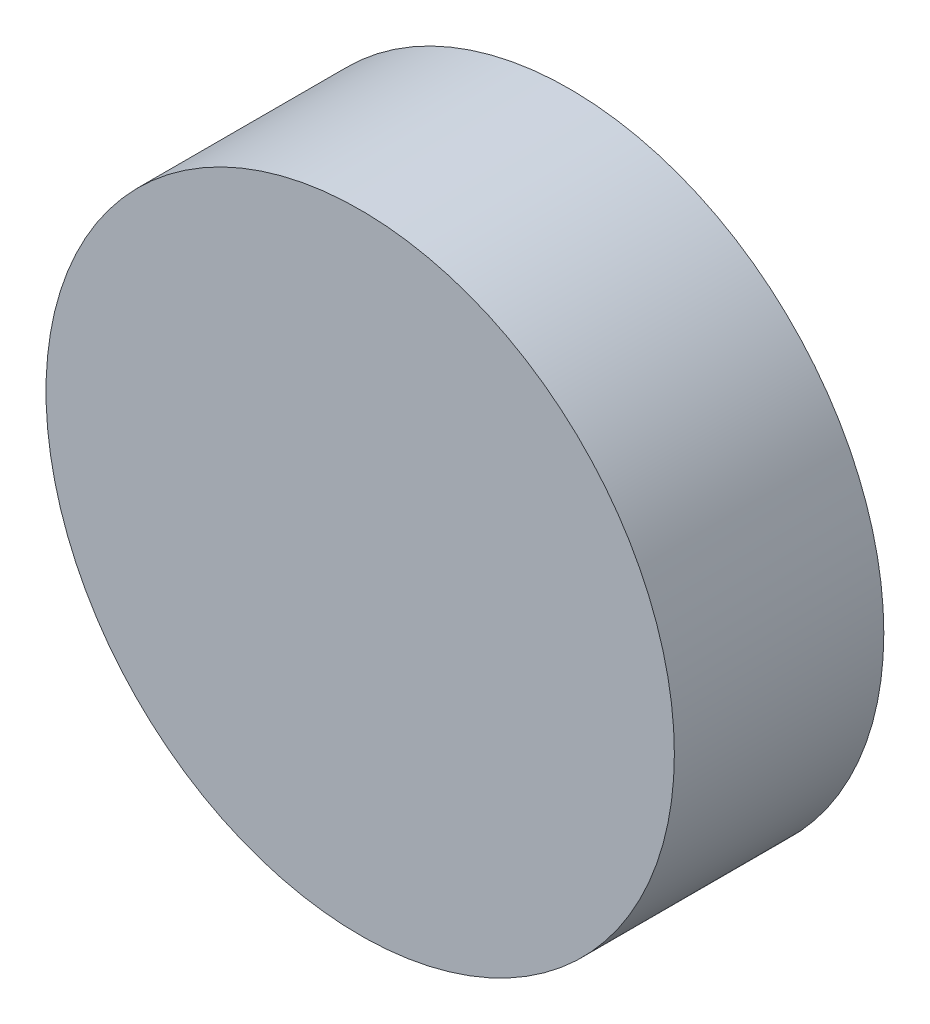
from build123d import *

# Parameters (mm, degrees)
ESQUISSE1_R      = 3
EXTRUSION1_DEPTH = 2


with BuildPart() as part:
    # Esquisse1 → Extrusion1 (new body)
    with BuildSketch(Plane.XY):
        Circle(ESQUISSE1_R)
    extrude(amount=EXTRUSION1_DEPTH)


solid = part.part
